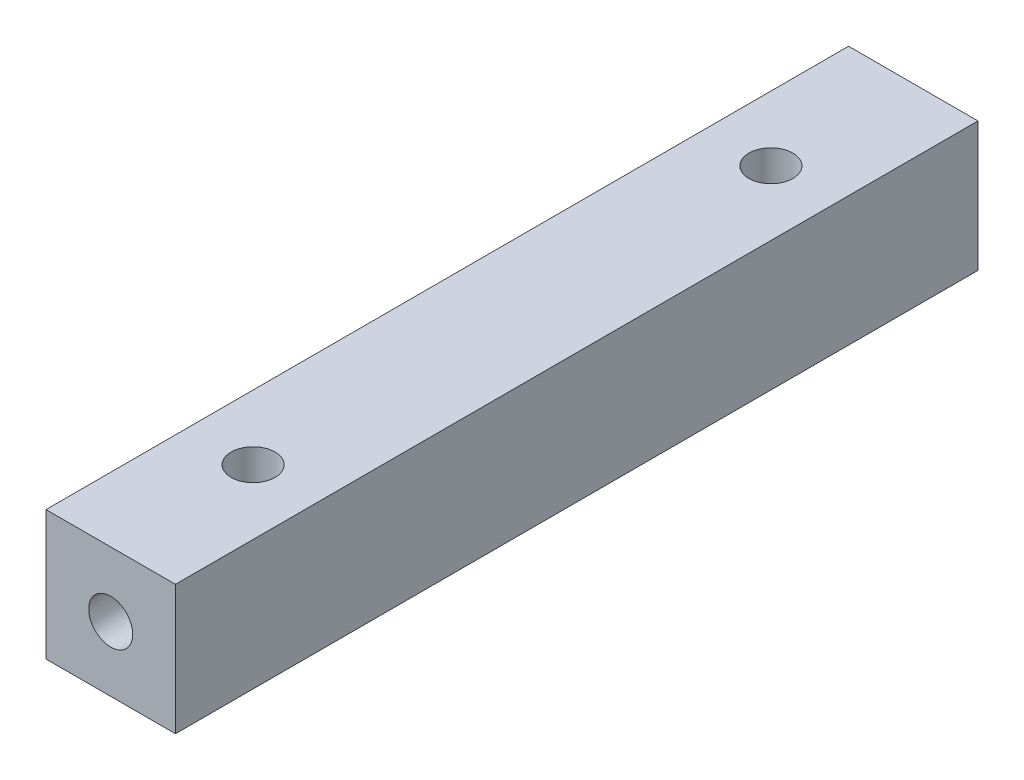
ISO-10303-21;
HEADER;
FILE_DESCRIPTION(('STEP AP214'),'2;1');
FILE_NAME('part.step','',(''),(''),'','','');
FILE_SCHEMA(('AUTOMOTIVE_DESIGN { 1 0 10303 214 1 1 1 1 }'));
ENDSEC;
DATA;
#1=APPLICATION_CONTEXT('core data for automotive mechanical design processes');
#2=APPLICATION_PROTOCOL_DEFINITION('international standard','automotive_design',2000,#1);
#3=PRODUCT_CONTEXT('',#1,'mechanical');
#4=PRODUCT('Part','Part','',(#3));
#5=PRODUCT_RELATED_PRODUCT_CATEGORY('part','',(#4));
#6=PRODUCT_DEFINITION_FORMATION('','',#4);
#7=PRODUCT_DEFINITION_CONTEXT('part definition',#1,'design');
#8=PRODUCT_DEFINITION('design','',#6,#7);
#9=PRODUCT_DEFINITION_SHAPE('','',#8);
#10=(LENGTH_UNIT() NAMED_UNIT(*) SI_UNIT(.MILLI.,.METRE.));
#11=(NAMED_UNIT(*) PLANE_ANGLE_UNIT() SI_UNIT($,.RADIAN.));
#12=(NAMED_UNIT(*) SI_UNIT($,.STERADIAN.) SOLID_ANGLE_UNIT());
#13=UNCERTAINTY_MEASURE_WITH_UNIT(LENGTH_MEASURE(1.E-05),#10,'distance_accuracy_value','');
#14=(GEOMETRIC_REPRESENTATION_CONTEXT(3) GLOBAL_UNCERTAINTY_ASSIGNED_CONTEXT((#13)) GLOBAL_UNIT_ASSIGNED_CONTEXT((#10,
#11,#12)) REPRESENTATION_CONTEXT('',''));
#15=CARTESIAN_POINT('',(0.,0.,0.));
#16=DIRECTION('',(0.,0.,1.));
#17=DIRECTION('',(1.,0.,0.));
#18=AXIS2_PLACEMENT_3D('',#15,#16,#17);
#19=CARTESIAN_POINT('',(0.,10.,-62.0000000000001));
#20=DIRECTION('',(0.,0.,-1.));
#21=DIRECTION('',(-1.,0.,0.));
#22=AXIS2_PLACEMENT_3D('',#19,#20,#21);
#23=CYLINDRICAL_SURFACE('',#22,3.39999999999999);
#24=CARTESIAN_POINT('',(0.,10.,-62.0000000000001));
#25=DIRECTION('',(0.,0.,-1.));
#26=DIRECTION('',(-1.,0.,0.));
#27=AXIS2_PLACEMENT_3D('',#24,#25,#26);
#28=CIRCLE('',#27,3.39999999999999);
#29=CARTESIAN_POINT('',(-3.39999999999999,10.,-62.0000000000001));
#30=VERTEX_POINT('',#29);
#31=EDGE_CURVE('E142',#30,#30,#28,.T.);
#32=ORIENTED_EDGE('',*,*,#31,.T.);
#33=EDGE_LOOP('',(#32));
#34=FACE_BOUND('',#33,.T.);
#35=CARTESIAN_POINT('',(1.11022302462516E-12,10.,-40.0000000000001));
#36=DIRECTION('',(0.,-0.707106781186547,-0.707106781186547));
#37=DIRECTION('',(0.,0.707106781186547,-0.707106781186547));
#38=AXIS2_PLACEMENT_3D('',#35,#36,#37);
#39=ELLIPSE('',#38,4.80832611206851,3.39999999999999);
#40=CARTESIAN_POINT('',(3.40000000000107,10.,-40.));
#41=VERTEX_POINT('',#40);
#42=CARTESIAN_POINT('',(-3.3999999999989,10.,-40.0000000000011));
#43=VERTEX_POINT('',#42);
#44=EDGE_CURVE('E148',#41,#43,#39,.F.);
#45=ORIENTED_EDGE('',*,*,#44,.T.);
#46=CARTESIAN_POINT('',(1.11022302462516E-12,10.,-40.0000000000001));
#47=DIRECTION('',(0.,0.707106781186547,-0.707106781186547));
#48=DIRECTION('',(0.,-0.707106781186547,-0.707106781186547));
#49=AXIS2_PLACEMENT_3D('',#46,#47,#48);
#50=ELLIPSE('',#49,4.80832611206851,3.39999999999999);
#51=EDGE_CURVE('E131',#43,#41,#50,.F.);
#52=ORIENTED_EDGE('',*,*,#51,.T.);
#53=EDGE_LOOP('',(#45,#52));
#54=FACE_BOUND('',#53,.T.);
#55=ADVANCED_FACE('F42',(#34,#54),#23,.F.);
#56=CARTESIAN_POINT('',(1.11022302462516E-12,9.9999999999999,62.));
#57=DIRECTION('',(0.,0.,1.));
#58=DIRECTION('',(1.,0.,0.));
#59=AXIS2_PLACEMENT_3D('',#56,#57,#58);
#60=CYLINDRICAL_SURFACE('',#59,3.39999999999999);
#61=CARTESIAN_POINT('',(1.11022302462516E-12,9.9999999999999,62.));
#62=DIRECTION('',(0.,0.,1.));
#63=DIRECTION('',(1.,0.,0.));
#64=AXIS2_PLACEMENT_3D('',#61,#62,#63);
#65=CIRCLE('',#64,3.39999999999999);
#66=CARTESIAN_POINT('',(3.4000000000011,9.9999999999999,62.));
#67=VERTEX_POINT('',#66);
#68=EDGE_CURVE('E183',#67,#67,#65,.T.);
#69=ORIENTED_EDGE('',*,*,#68,.T.);
#70=EDGE_LOOP('',(#69));
#71=FACE_BOUND('',#70,.T.);
#72=CARTESIAN_POINT('',(0.,10.,40.));
#73=DIRECTION('',(0.,-0.707106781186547,0.707106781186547));
#74=DIRECTION('',(0.,0.707106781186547,0.707106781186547));
#75=AXIS2_PLACEMENT_3D('',#72,#73,#74);
#76=ELLIPSE('',#75,4.80832611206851,3.39999999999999);
#77=CARTESIAN_POINT('',(-3.39999999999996,10.,40.));
#78=VERTEX_POINT('',#77);
#79=CARTESIAN_POINT('',(3.40000000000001,10.,40.0000000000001));
#80=VERTEX_POINT('',#79);
#81=EDGE_CURVE('E174',#78,#80,#76,.F.);
#82=ORIENTED_EDGE('',*,*,#81,.T.);
#83=CARTESIAN_POINT('',(0.,10.,40.));
#84=DIRECTION('',(0.,0.707106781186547,0.707106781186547));
#85=DIRECTION('',(0.,-0.707106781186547,0.707106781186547));
#86=AXIS2_PLACEMENT_3D('',#83,#84,#85);
#87=ELLIPSE('',#86,4.80832611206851,3.39999999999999);
#88=EDGE_CURVE('E169',#80,#78,#87,.F.);
#89=ORIENTED_EDGE('',*,*,#88,.T.);
#90=EDGE_LOOP('',(#82,#89));
#91=FACE_BOUND('',#90,.T.);
#92=ADVANCED_FACE('F273',(#71,#91),#60,.F.);
#93=CARTESIAN_POINT('',(-9.9999999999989,0.,62.0000000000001));
#94=DIRECTION('',(1.,0.,0.));
#95=DIRECTION('',(0.,0.,-1.));
#96=AXIS2_PLACEMENT_3D('',#93,#94,#95);
#97=PLANE('',#96);
#98=DIRECTION('',(0.,-1.,0.));
#99=VECTOR('',#98,1.);
#100=CARTESIAN_POINT('',(-10.,0.,-61.9999999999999));
#101=LINE('',#100,#99);
#102=CARTESIAN_POINT('',(-9.99999999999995,20.,-61.9999999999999));
#103=VERTEX_POINT('',#102);
#104=CARTESIAN_POINT('',(-10.,0.,-61.9999999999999));
#105=VERTEX_POINT('',#104);
#106=EDGE_CURVE('E186',#103,#105,#101,.T.);
#107=ORIENTED_EDGE('',*,*,#106,.T.);
#108=DIRECTION('',(0.,0.,-1.));
#109=VECTOR('',#108,1.);
#110=CARTESIAN_POINT('',(-9.9999999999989,0.,62.0000000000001));
#111=LINE('',#110,#109);
#112=CARTESIAN_POINT('',(-9.9999999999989,0.,62.0000000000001));
#113=VERTEX_POINT('',#112);
#114=EDGE_CURVE('E224',#113,#105,#111,.T.);
#115=ORIENTED_EDGE('',*,*,#114,.F.);
#116=DIRECTION('',(0.,-1.,0.));
#117=VECTOR('',#116,1.);
#118=CARTESIAN_POINT('',(-9.9999999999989,0.,62.0000000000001));
#119=LINE('',#118,#117);
#120=CARTESIAN_POINT('',(-9.9999999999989,19.9999999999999,62.0000000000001));
#121=VERTEX_POINT('',#120);
#122=EDGE_CURVE('E187',#121,#113,#119,.T.);
#123=ORIENTED_EDGE('',*,*,#122,.F.);
#124=DIRECTION('',(0.,0.,-1.));
#125=VECTOR('',#124,1.);
#126=CARTESIAN_POINT('',(-9.9999999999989,19.9999999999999,62.0000000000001));
#127=LINE('',#126,#125);
#128=EDGE_CURVE('E201',#121,#103,#127,.T.);
#129=ORIENTED_EDGE('',*,*,#128,.T.);
#130=EDGE_LOOP('',(#107,#115,#123,#129));
#131=FACE_BOUND('',#130,.T.);
#132=ADVANCED_FACE('F44',(#131),#97,.F.);
#133=CARTESIAN_POINT('',(-9.9999999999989,0.,62.0000000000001));
#134=DIRECTION('',(0.,1.,0.));
#135=DIRECTION('',(0.,0.,1.));
#136=AXIS2_PLACEMENT_3D('',#133,#134,#135);
#137=PLANE('',#136);
#138=CARTESIAN_POINT('',(1.11022302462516E-12,0.,-40.));
#139=DIRECTION('',(0.,1.,0.));
#140=DIRECTION('',(0.,0.,1.));
#141=AXIS2_PLACEMENT_3D('',#138,#139,#140);
#142=CIRCLE('',#141,3.4);
#143=CARTESIAN_POINT('',(1.11022302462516E-12,0.,-36.6));
#144=VERTEX_POINT('',#143);
#145=EDGE_CURVE('E460',#144,#144,#142,.T.);
#146=ORIENTED_EDGE('',*,*,#145,.T.);
#147=EDGE_LOOP('',(#146));
#148=FACE_BOUND('',#147,.T.);
#149=CARTESIAN_POINT('',(0.,0.,40.));
#150=DIRECTION('',(0.,1.,0.));
#151=DIRECTION('',(0.,0.,1.));
#152=AXIS2_PLACEMENT_3D('',#149,#150,#151);
#153=CIRCLE('',#152,3.4);
#154=CARTESIAN_POINT('',(0.,0.,43.4));
#155=VERTEX_POINT('',#154);
#156=EDGE_CURVE('E153',#155,#155,#153,.T.);
#157=ORIENTED_EDGE('',*,*,#156,.T.);
#158=EDGE_LOOP('',(#157));
#159=FACE_BOUND('',#158,.T.);
#160=DIRECTION('',(1.,0.,0.));
#161=VECTOR('',#160,1.);
#162=CARTESIAN_POINT('',(-10.,0.,-61.9999999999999));
#163=LINE('',#162,#161);
#164=CARTESIAN_POINT('',(10.,0.,-62.0000000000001));
#165=VERTEX_POINT('',#164);
#166=EDGE_CURVE('E205',#105,#165,#163,.T.);
#167=ORIENTED_EDGE('',*,*,#166,.T.);
#168=DIRECTION('',(0.,0.,-1.));
#169=VECTOR('',#168,1.);
#170=CARTESIAN_POINT('',(10.0000000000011,0.,62.0000000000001));
#171=LINE('',#170,#169);
#172=CARTESIAN_POINT('',(10.0000000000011,0.,62.0000000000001));
#173=VERTEX_POINT('',#172);
#174=EDGE_CURVE('E220',#173,#165,#171,.T.);
#175=ORIENTED_EDGE('',*,*,#174,.F.);
#176=DIRECTION('',(1.,0.,0.));
#177=VECTOR('',#176,1.);
#178=CARTESIAN_POINT('',(-9.9999999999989,0.,62.0000000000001));
#179=LINE('',#178,#177);
#180=EDGE_CURVE('E191',#113,#173,#179,.T.);
#181=ORIENTED_EDGE('',*,*,#180,.F.);
#182=ORIENTED_EDGE('',*,*,#114,.T.);
#183=EDGE_LOOP('',(#167,#175,#181,#182));
#184=FACE_BOUND('',#183,.T.);
#185=ADVANCED_FACE('F371',(#148,#159,#184),#137,.F.);
#186=CARTESIAN_POINT('',(10.0000000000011,0.,62.0000000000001));
#187=DIRECTION('',(-1.,0.,0.));
#188=DIRECTION('',(0.,0.,1.));
#189=AXIS2_PLACEMENT_3D('',#186,#187,#188);
#190=PLANE('',#189);
#191=DIRECTION('',(0.,1.,0.));
#192=VECTOR('',#191,1.);
#193=CARTESIAN_POINT('',(10.,0.,-62.0000000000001));
#194=LINE('',#193,#192);
#195=CARTESIAN_POINT('',(10.,20.,-62.0000000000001));
#196=VERTEX_POINT('',#195);
#197=EDGE_CURVE('E208',#165,#196,#194,.T.);
#198=ORIENTED_EDGE('',*,*,#197,.T.);
#199=DIRECTION('',(0.,0.,-1.));
#200=VECTOR('',#199,1.);
#201=CARTESIAN_POINT('',(10.0000000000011,19.9999999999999,62.0000000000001));
#202=LINE('',#201,#200);
#203=CARTESIAN_POINT('',(10.0000000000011,19.9999999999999,62.0000000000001));
#204=VERTEX_POINT('',#203);
#205=EDGE_CURVE('E216',#204,#196,#202,.T.);
#206=ORIENTED_EDGE('',*,*,#205,.F.);
#207=DIRECTION('',(0.,1.,0.));
#208=VECTOR('',#207,1.);
#209=CARTESIAN_POINT('',(10.0000000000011,0.,62.0000000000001));
#210=LINE('',#209,#208);
#211=EDGE_CURVE('E195',#173,#204,#210,.T.);
#212=ORIENTED_EDGE('',*,*,#211,.F.);
#213=ORIENTED_EDGE('',*,*,#174,.T.);
#214=EDGE_LOOP('',(#198,#206,#212,#213));
#215=FACE_BOUND('',#214,.T.);
#216=ADVANCED_FACE('F362',(#215),#190,.F.);
#217=CARTESIAN_POINT('',(-9.9999999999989,19.9999999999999,62.0000000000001));
#218=DIRECTION('',(0.,-1.,0.));
#219=DIRECTION('',(0.,0.,-1.));
#220=AXIS2_PLACEMENT_3D('',#217,#218,#219);
#221=PLANE('',#220);
#222=CARTESIAN_POINT('',(1.11022302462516E-12,20.,-40.));
#223=DIRECTION('',(0.,1.,0.));
#224=DIRECTION('',(0.,0.,1.));
#225=AXIS2_PLACEMENT_3D('',#222,#223,#224);
#226=CIRCLE('',#225,3.39999999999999);
#227=CARTESIAN_POINT('',(1.11022302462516E-12,20.,-36.6000000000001));
#228=VERTEX_POINT('',#227);
#229=EDGE_CURVE('E475',#228,#228,#226,.T.);
#230=ORIENTED_EDGE('',*,*,#229,.F.);
#231=EDGE_LOOP('',(#230));
#232=FACE_BOUND('',#231,.T.);
#233=CARTESIAN_POINT('',(0.,20.,40.));
#234=DIRECTION('',(0.,1.,0.));
#235=DIRECTION('',(0.,0.,1.));
#236=AXIS2_PLACEMENT_3D('',#233,#234,#235);
#237=CIRCLE('',#236,3.39999999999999);
#238=CARTESIAN_POINT('',(0.,20.,43.4));
#239=VERTEX_POINT('',#238);
#240=EDGE_CURVE('E157',#239,#239,#237,.T.);
#241=ORIENTED_EDGE('',*,*,#240,.F.);
#242=EDGE_LOOP('',(#241));
#243=FACE_BOUND('',#242,.T.);
#244=DIRECTION('',(-1.,0.,0.));
#245=VECTOR('',#244,1.);
#246=CARTESIAN_POINT('',(-9.99999999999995,20.,-61.9999999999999));
#247=LINE('',#246,#245);
#248=EDGE_CURVE('E192',#196,#103,#247,.T.);
#249=ORIENTED_EDGE('',*,*,#248,.T.);
#250=ORIENTED_EDGE('',*,*,#128,.F.);
#251=DIRECTION('',(-1.,0.,0.));
#252=VECTOR('',#251,1.);
#253=CARTESIAN_POINT('',(-9.9999999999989,19.9999999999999,62.0000000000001));
#254=LINE('',#253,#252);
#255=EDGE_CURVE('E198',#204,#121,#254,.T.);
#256=ORIENTED_EDGE('',*,*,#255,.F.);
#257=ORIENTED_EDGE('',*,*,#205,.T.);
#258=EDGE_LOOP('',(#249,#250,#256,#257));
#259=FACE_BOUND('',#258,.T.);
#260=ADVANCED_FACE('F353',(#232,#243,#259),#221,.F.);
#261=CARTESIAN_POINT('',(-9.9999999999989,19.9999999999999,62.0000000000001));
#262=DIRECTION('',(0.,0.,-1.));
#263=DIRECTION('',(-1.,0.,0.));
#264=AXIS2_PLACEMENT_3D('',#261,#262,#263);
#265=PLANE('',#264);
#266=ORIENTED_EDGE('',*,*,#68,.F.);
#267=EDGE_LOOP('',(#266));
#268=FACE_BOUND('',#267,.T.);
#269=ORIENTED_EDGE('',*,*,#122,.T.);
#270=ORIENTED_EDGE('',*,*,#180,.T.);
#271=ORIENTED_EDGE('',*,*,#211,.T.);
#272=ORIENTED_EDGE('',*,*,#255,.T.);
#273=EDGE_LOOP('',(#269,#270,#271,#272));
#274=FACE_BOUND('',#273,.T.);
#275=ADVANCED_FACE('F344',(#268,#274),#265,.F.);
#276=CARTESIAN_POINT('',(-9.99999999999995,20.,-61.9999999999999));
#277=DIRECTION('',(0.,0.,-1.));
#278=DIRECTION('',(-1.,0.,0.));
#279=AXIS2_PLACEMENT_3D('',#276,#277,#278);
#280=PLANE('',#279);
#281=ORIENTED_EDGE('',*,*,#31,.F.);
#282=EDGE_LOOP('',(#281));
#283=FACE_BOUND('',#282,.T.);
#284=ORIENTED_EDGE('',*,*,#106,.F.);
#285=ORIENTED_EDGE('',*,*,#248,.F.);
#286=ORIENTED_EDGE('',*,*,#197,.F.);
#287=ORIENTED_EDGE('',*,*,#166,.F.);
#288=EDGE_LOOP('',(#284,#285,#286,#287));
#289=FACE_BOUND('',#288,.T.);
#290=ADVANCED_FACE('F248',(#283,#289),#280,.T.);
#291=CARTESIAN_POINT('',(0.,20.,40.));
#292=DIRECTION('',(0.,1.,0.));
#293=DIRECTION('',(0.,0.,1.));
#294=AXIS2_PLACEMENT_3D('',#291,#292,#293);
#295=CYLINDRICAL_SURFACE('',#294,3.39999999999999);
#296=ORIENTED_EDGE('',*,*,#240,.T.);
#297=EDGE_LOOP('',(#296));
#298=FACE_BOUND('',#297,.T.);
#299=ORIENTED_EDGE('',*,*,#156,.F.);
#300=EDGE_LOOP('',(#299));
#301=FACE_BOUND('',#300,.T.);
#302=ORIENTED_EDGE('',*,*,#81,.F.);
#303=CARTESIAN_POINT('',(0.,10.,40.));
#304=DIRECTION('',(0.,0.707106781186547,0.707106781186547));
#305=DIRECTION('',(0.,-0.707106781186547,0.707106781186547));
#306=AXIS2_PLACEMENT_3D('',#303,#304,#305);
#307=ELLIPSE('',#306,4.80832611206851,3.39999999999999);
#308=CARTESIAN_POINT('',(-3.39079636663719,10.2499999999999,39.7500000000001));
#309=VERTEX_POINT('',#308);
#310=EDGE_CURVE('E164',#309,#78,#307,.T.);
#311=ORIENTED_EDGE('',*,*,#310,.F.);
#312=CARTESIAN_POINT('',(-2.8478101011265,3.70706174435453,41.8574115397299));
#313=CARTESIAN_POINT('',(-2.89754494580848,3.86899487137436,41.7811104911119));
#314=CARTESIAN_POINT('',(-2.94304604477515,4.03213135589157,41.7046961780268));
#315=CARTESIAN_POINT('',(-3.0262967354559,4.36043480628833,41.5521346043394));
#316=CARTESIAN_POINT('',(-3.06404873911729,4.52560112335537,41.4759872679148));
#317=CARTESIAN_POINT('',(-3.13255597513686,4.85773132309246,41.3243859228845));
#318=CARTESIAN_POINT('',(-3.16330943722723,5.0246956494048,41.2489320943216));
#319=CARTESIAN_POINT('',(-3.21838631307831,5.36023761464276,41.0992500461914));
#320=CARTESIAN_POINT('',(-3.24270924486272,5.52881537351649,41.0250219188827));
#321=CARTESIAN_POINT('',(-3.2853043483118,5.86633659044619,40.8789315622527));
#322=CARTESIAN_POINT('',(-3.30361743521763,6.03526934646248,40.8070564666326));
#323=CARTESIAN_POINT('',(-3.33493184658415,6.3747123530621,40.6659212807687));
#324=CARTESIAN_POINT('',(-3.3479331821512,6.54522260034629,40.5966611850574));
#325=CARTESIAN_POINT('',(-3.36917473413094,6.88788073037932,40.461857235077));
#326=CARTESIAN_POINT('',(-3.37741782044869,7.06002756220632,40.3963111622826));
#327=CARTESIAN_POINT('',(-3.3898228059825,7.40632277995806,40.270362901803));
#328=CARTESIAN_POINT('',(-3.39398554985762,7.58047074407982,40.2099596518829));
#329=CARTESIAN_POINT('',(-3.39737327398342,7.81226854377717,40.1348828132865));
#330=CARTESIAN_POINT('',(-3.39803254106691,7.86885613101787,40.1169693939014));
#331=CARTESIAN_POINT('',(-3.39905633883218,7.98228683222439,40.0819847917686));
#332=CARTESIAN_POINT('',(-3.39942090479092,8.03912991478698,40.0649135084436));
#333=CARTESIAN_POINT('',(-3.40012964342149,8.21032790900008,40.0150222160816));
#334=CARTESIAN_POINT('',(-3.40008547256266,8.32509732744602,39.9836079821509));
#335=CARTESIAN_POINT('',(-3.39913523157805,8.60615930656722,39.912674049));
#336=CARTESIAN_POINT('',(-3.39786151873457,8.77308391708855,39.8755979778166));
#337=CARTESIAN_POINT('',(-3.39504455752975,9.10926828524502,39.8138749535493));
#338=CARTESIAN_POINT('',(-3.39350133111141,9.27852785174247,39.7892269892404));
#339=CARTESIAN_POINT('',(-3.39121670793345,9.61817021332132,39.7551404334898));
#340=CARTESIAN_POINT('',(-3.39047313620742,9.78854868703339,39.7456605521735));
#341=CARTESIAN_POINT('',(-3.39027949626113,10.1294118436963,39.743072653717));
#342=CARTESIAN_POINT('',(-3.3908291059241,10.2998964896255,39.7499605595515));
#343=CARTESIAN_POINT('',(-3.39238265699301,10.5615488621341,39.7724319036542));
#344=CARTESIAN_POINT('',(-3.39306258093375,10.6532303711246,39.7825778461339));
#345=CARTESIAN_POINT('',(-3.39453952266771,10.8360266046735,39.8069861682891));
#346=CARTESIAN_POINT('',(-3.39533652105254,10.9271414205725,39.8212478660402));
#347=CARTESIAN_POINT('',(-3.39765214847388,11.199820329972,39.8696213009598));
#348=CARTESIAN_POINT('',(-3.39909243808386,11.380406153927,39.9092917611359));
#349=CARTESIAN_POINT('',(-3.40016307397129,11.6984582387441,39.9895464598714));
#350=CARTESIAN_POINT('',(-3.40012714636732,11.8365037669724,40.0279263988));
#351=CARTESIAN_POINT('',(-3.39847854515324,12.1105316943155,40.1097703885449));
#352=CARTESIAN_POINT('',(-3.39687160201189,12.246519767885,40.153215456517));
#353=CARTESIAN_POINT('',(-3.39419731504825,12.3818222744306,40.1985562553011));
#354=B_SPLINE_CURVE_WITH_KNOTS('',3,(#312,#313,#314,#315,#316,#317,#318,#319,#320,#321,#322,
#323,#324,#325,#326,#327,#328,#329,#330,#331,#332,#333,#334,#335,#336,#337,#338,#339,#340,#341,
#342,#343,#344,#345,#346,#347,#348,#349,#350,#351,#352,#353),.UNSPECIFIED.,.F.,.F.,(4,2,2,2,2,2,
2,2,2,2,2,2,2,2,2,2,2,2,2,2,4),(0.,0.557261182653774,1.11434865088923,1.67157687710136,
2.22884685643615,2.78224016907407,3.33563232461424,3.88869035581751,4.44163387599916,
4.6197050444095,4.79775489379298,5.15465677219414,5.66727681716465,6.1798551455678,
6.69103576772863,7.20208907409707,7.47873582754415,7.75533677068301,8.30947797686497,
8.73922172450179,9.16740375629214),.UNSPECIFIED.);
#355=CARTESIAN_POINT('',(-3.39079636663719,9.75000000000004,39.7500000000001));
#356=VERTEX_POINT('',#355);
#357=EDGE_CURVE('E228',#356,#309,#354,.T.);
#358=ORIENTED_EDGE('',*,*,#357,.F.);
#359=CARTESIAN_POINT('',(0.,10.,40.));
#360=DIRECTION('',(0.,-0.707106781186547,0.707106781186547));
#361=DIRECTION('',(0.,0.707106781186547,0.707106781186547));
#362=AXIS2_PLACEMENT_3D('',#359,#360,#361);
#363=ELLIPSE('',#362,4.80832611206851,3.39999999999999);
#364=EDGE_CURVE('E161',#78,#356,#363,.T.);
#365=ORIENTED_EDGE('',*,*,#364,.F.);
#366=ORIENTED_EDGE('',*,*,#88,.F.);
#367=CARTESIAN_POINT('',(3.39079636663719,9.75000000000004,39.75));
#368=VERTEX_POINT('',#367);
#369=EDGE_CURVE('E165',#368,#80,#363,.T.);
#370=ORIENTED_EDGE('',*,*,#369,.F.);
#371=CARTESIAN_POINT('',(3.39419731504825,12.3818222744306,40.1985562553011));
#372=CARTESIAN_POINT('',(3.39686643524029,12.2467750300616,40.153298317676));
#373=CARTESIAN_POINT('',(3.39847252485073,12.1110310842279,40.1099286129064));
#374=CARTESIAN_POINT('',(3.40012712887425,11.836999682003,40.0280652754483));
#375=CARTESIAN_POINT('',(3.40016418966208,11.6987008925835,39.9896095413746));
#376=CARTESIAN_POINT('',(3.39913665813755,11.3936483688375,39.9126309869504));
#377=CARTESIAN_POINT('',(3.39785911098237,11.2265311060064,39.8755138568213));
#378=CARTESIAN_POINT('',(3.39503728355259,10.889963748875,39.8137473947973));
#379=CARTESIAN_POINT('',(3.39349303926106,10.7205139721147,39.7890963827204));
#380=CARTESIAN_POINT('',(3.39121207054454,10.3808711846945,39.7550786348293));
#381=CARTESIAN_POINT('',(3.39047138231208,10.210686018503,39.7456367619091));
#382=CARTESIAN_POINT('',(3.39028059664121,9.87020707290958,39.7430877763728));
#383=CARTESIAN_POINT('',(3.39083020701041,9.69991332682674,39.7499769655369));
#384=CARTESIAN_POINT('',(3.39238250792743,9.43847880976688,39.7724294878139));
#385=CARTESIAN_POINT('',(3.39306217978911,9.34682511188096,39.7825715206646));
#386=CARTESIAN_POINT('',(3.39453859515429,9.16408234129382,39.806970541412));
#387=CARTESIAN_POINT('',(3.39533531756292,9.07299316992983,39.8212267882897));
#388=CARTESIAN_POINT('',(3.3968788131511,8.89125148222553,39.8534622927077));
#389=CARTESIAN_POINT('',(3.39762545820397,8.80060059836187,39.8714506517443));
#390=CARTESIAN_POINT('',(3.39888280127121,8.62000387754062,39.9106606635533));
#391=CARTESIAN_POINT('',(3.39939349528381,8.53005805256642,39.9318823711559));
#392=CARTESIAN_POINT('',(3.4002505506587,8.27574128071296,39.9960606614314));
#393=CARTESIAN_POINT('',(3.40010009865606,8.11220122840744,40.0423218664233));
#394=CARTESIAN_POINT('',(3.39740699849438,7.78724604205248,40.1417902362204));
#395=CARTESIAN_POINT('',(3.39486350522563,7.62583167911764,40.1949998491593));
#396=CARTESIAN_POINT('',(3.38661286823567,7.30465094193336,40.3065758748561));
#397=CARTESIAN_POINT('',(3.38090161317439,7.14488698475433,40.3649489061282));
#398=CARTESIAN_POINT('',(3.36571786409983,6.82698019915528,40.4854190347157));
#399=CARTESIAN_POINT('',(3.35624585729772,6.66883716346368,40.5475156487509));
#400=CARTESIAN_POINT('',(3.33305411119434,6.35388231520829,40.6744769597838));
#401=CARTESIAN_POINT('',(3.31933210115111,6.19707126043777,40.7393431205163));
#402=CARTESIAN_POINT('',(3.28722215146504,5.88475723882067,40.8710732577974));
#403=CARTESIAN_POINT('',(3.26883387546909,5.72925436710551,40.9379373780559));
#404=CARTESIAN_POINT('',(3.22701448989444,5.41970023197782,41.0730211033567));
#405=CARTESIAN_POINT('',(3.20358830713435,5.26564770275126,41.1412393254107));
#406=CARTESIAN_POINT('',(3.15126921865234,4.95890479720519,41.2786337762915));
#407=CARTESIAN_POINT('',(3.12237640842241,4.80621439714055,41.3478099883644));
#408=CARTESIAN_POINT('',(3.05702606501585,4.49446079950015,41.4903235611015));
#409=CARTESIAN_POINT('',(3.02025453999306,4.33547650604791,41.563691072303));
#410=CARTESIAN_POINT('',(2.93955922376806,4.01964452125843,41.710544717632));
#411=CARTESIAN_POINT('',(2.89564426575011,3.86279444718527,41.7840305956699));
#412=CARTESIAN_POINT('',(2.8478101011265,3.70706174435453,41.8574115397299));
#413=B_SPLINE_CURVE_WITH_KNOTS('',3,(#371,#372,#373,#374,#375,#376,#377,#378,#379,#380,#381,
#382,#383,#384,#385,#386,#387,#388,#389,#390,#391,#392,#393,#394,#395,#396,#397,#398,#399,#400,
#401,#402,#403,#404,#405,#406,#407,#408,#409,#410,#411,#412),.UNSPECIFIED.,.F.,.F.,(4,2,2,2,2,2,
2,2,2,2,2,2,2,2,2,2,2,2,2,2,4),(0.,0.427403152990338,0.857925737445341,1.37113614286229,
1.88427735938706,2.39487566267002,2.90535835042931,3.18192284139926,3.45843755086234,
3.7356346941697,4.01283653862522,4.52246141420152,5.03226633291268,5.5427344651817,
6.05313648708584,6.56381168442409,7.0745237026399,7.5847385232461,8.09494443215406,
8.63154169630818,9.16748040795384),.UNSPECIFIED.);
#414=CARTESIAN_POINT('',(3.39079636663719,10.2499999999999,39.75));
#415=VERTEX_POINT('',#414);
#416=EDGE_CURVE('E127',#415,#368,#413,.T.);
#417=ORIENTED_EDGE('',*,*,#416,.F.);
#418=EDGE_CURVE('E170',#80,#415,#307,.T.);
#419=ORIENTED_EDGE('',*,*,#418,.F.);
#420=EDGE_LOOP('',(#302,#311,#358,#365,#366,#370,#417,#419));
#421=FACE_BOUND('',#420,.T.);
#422=ADVANCED_FACE('F243',(#298,#301,#421),#295,.F.);
#423=CARTESIAN_POINT('',(0.,10.,39.75));
#424=DIRECTION('',(0.,0.,1.));
#425=DIRECTION('',(1.,0.,0.));
#426=AXIS2_PLACEMENT_3D('',#423,#424,#425);
#427=CONICAL_SURFACE('',#426,3.39999999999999,1.02974425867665);
#428=CARTESIAN_POINT('',(0.,10.,39.75));
#429=DIRECTION('',(0.,0.,1.));
#430=DIRECTION('',(1.,0.,0.));
#431=AXIS2_PLACEMENT_3D('',#428,#429,#430);
#432=CIRCLE('',#431,3.39999999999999);
#433=EDGE_CURVE('E178',#368,#415,#432,.T.);
#434=ORIENTED_EDGE('',*,*,#433,.T.);
#435=ORIENTED_EDGE('',*,*,#416,.T.);
#436=EDGE_LOOP('',(#434,#435));
#437=FACE_BOUND('',#436,.T.);
#438=ADVANCED_FACE('F247',(#437),#427,.F.);
#439=ORIENTED_EDGE('',*,*,#369,.T.);
#440=ORIENTED_EDGE('',*,*,#418,.T.);
#441=ORIENTED_EDGE('',*,*,#433,.F.);
#442=EDGE_LOOP('',(#439,#440,#441));
#443=FACE_BOUND('',#442,.T.);
#444=ADVANCED_FACE('F272',(#443),#60,.F.);
#445=EDGE_CURVE('E182',#309,#356,#432,.T.);
#446=ORIENTED_EDGE('',*,*,#445,.T.);
#447=ORIENTED_EDGE('',*,*,#357,.T.);
#448=EDGE_LOOP('',(#446,#447));
#449=FACE_BOUND('',#448,.T.);
#450=ADVANCED_FACE('F240',(#449),#427,.F.);
#451=ORIENTED_EDGE('',*,*,#445,.F.);
#452=ORIENTED_EDGE('',*,*,#310,.T.);
#453=ORIENTED_EDGE('',*,*,#364,.T.);
#454=EDGE_LOOP('',(#451,#452,#453));
#455=FACE_BOUND('',#454,.T.);
#456=ADVANCED_FACE('F263',(#455),#60,.F.);
#457=CARTESIAN_POINT('',(1.11022302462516E-12,20.,-40.));
#458=DIRECTION('',(0.,1.,0.));
#459=DIRECTION('',(0.,0.,1.));
#460=AXIS2_PLACEMENT_3D('',#457,#458,#459);
#461=CYLINDRICAL_SURFACE('',#460,3.39999999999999);
#462=ORIENTED_EDGE('',*,*,#229,.T.);
#463=EDGE_LOOP('',(#462));
#464=FACE_BOUND('',#463,.T.);
#465=ORIENTED_EDGE('',*,*,#145,.F.);
#466=EDGE_LOOP('',(#465));
#467=FACE_BOUND('',#466,.T.);
#468=CARTESIAN_POINT('',(2.84781010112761,3.70706174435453,-41.8574115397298));
#469=CARTESIAN_POINT('',(2.89754494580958,3.86899487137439,-41.7811104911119));
#470=CARTESIAN_POINT('',(2.94304604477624,4.03213135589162,-41.7046961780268));
#471=CARTESIAN_POINT('',(3.02629673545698,4.36043480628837,-41.5521346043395));
#472=CARTESIAN_POINT('',(3.06404873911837,4.5256011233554,-41.4759872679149));
#473=CARTESIAN_POINT('',(3.13255597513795,4.85773132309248,-41.3243859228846));
#474=CARTESIAN_POINT('',(3.16330943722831,5.02469564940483,-41.2489320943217));
#475=CARTESIAN_POINT('',(3.2183863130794,5.36023761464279,-41.0992500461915));
#476=CARTESIAN_POINT('',(3.24270924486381,5.52881537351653,-41.0250219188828));
#477=CARTESIAN_POINT('',(3.2853043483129,5.86633659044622,-40.8789315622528));
#478=CARTESIAN_POINT('',(3.30361743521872,6.03526934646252,-40.8070564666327));
#479=CARTESIAN_POINT('',(3.33493184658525,6.37471235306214,-40.6659212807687));
#480=CARTESIAN_POINT('',(3.3479331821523,6.54522260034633,-40.5966611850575));
#481=CARTESIAN_POINT('',(3.36917473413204,6.88788073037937,-40.4618572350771));
#482=CARTESIAN_POINT('',(3.37741782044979,7.06002756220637,-40.3963111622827));
#483=CARTESIAN_POINT('',(3.38982280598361,7.40632277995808,-40.270362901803));
#484=CARTESIAN_POINT('',(3.39398554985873,7.5804707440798,-40.2099596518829));
#485=CARTESIAN_POINT('',(3.39737327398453,7.81226854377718,-40.1348828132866));
#486=CARTESIAN_POINT('',(3.39803254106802,7.86885613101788,-40.1169693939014));
#487=CARTESIAN_POINT('',(3.39905633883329,7.98228683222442,-40.0819847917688));
#488=CARTESIAN_POINT('',(3.39942090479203,8.039129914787,-40.0649135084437));
#489=CARTESIAN_POINT('',(3.4001296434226,8.2103279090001,-40.0150222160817));
#490=CARTESIAN_POINT('',(3.40008547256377,8.32509732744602,-39.9836079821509));
#491=CARTESIAN_POINT('',(3.39913523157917,8.60615930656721,-39.912674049));
#492=CARTESIAN_POINT('',(3.39786151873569,8.77308391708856,-39.8755979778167));
#493=CARTESIAN_POINT('',(3.39504455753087,9.10926828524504,-39.8138749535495));
#494=CARTESIAN_POINT('',(3.39350133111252,9.27852785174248,-39.7892269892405));
#495=CARTESIAN_POINT('',(3.39121670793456,9.61817021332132,-39.7551404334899));
#496=CARTESIAN_POINT('',(3.39047313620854,9.7885486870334,-39.7456605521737));
#497=CARTESIAN_POINT('',(3.39027949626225,10.1294118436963,-39.743072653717));
#498=CARTESIAN_POINT('',(3.39082910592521,10.2998964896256,-39.7499605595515));
#499=CARTESIAN_POINT('',(3.39238265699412,10.5615488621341,-39.7724319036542));
#500=CARTESIAN_POINT('',(3.39306258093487,10.6532303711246,-39.7825778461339));
#501=CARTESIAN_POINT('',(3.39453952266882,10.8360266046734,-39.8069861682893));
#502=CARTESIAN_POINT('',(3.39533652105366,10.9271414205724,-39.8212478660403));
#503=CARTESIAN_POINT('',(3.39765214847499,11.199820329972,-39.8696213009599));
#504=CARTESIAN_POINT('',(3.39909243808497,11.3804061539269,-39.9092917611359));
#505=CARTESIAN_POINT('',(3.4001630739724,11.698458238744,-39.9895464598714));
#506=CARTESIAN_POINT('',(3.40012714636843,11.8365037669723,-40.0279263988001));
#507=CARTESIAN_POINT('',(3.39847854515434,12.1105316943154,-40.109770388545));
#508=CARTESIAN_POINT('',(3.396871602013,12.246519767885,-40.1532154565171));
#509=CARTESIAN_POINT('',(3.39419731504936,12.3818222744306,-40.1985562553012));
#510=B_SPLINE_CURVE_WITH_KNOTS('',3,(#468,#469,#470,#471,#472,#473,#474,#475,#476,#477,#478,
#479,#480,#481,#482,#483,#484,#485,#486,#487,#488,#489,#490,#491,#492,#493,#494,#495,#496,#497,
#498,#499,#500,#501,#502,#503,#504,#505,#506,#507,#508,#509),.UNSPECIFIED.,.F.,.F.,(4,2,2,2,2,2,
2,2,2,2,2,2,2,2,2,2,2,2,2,2,4),(0.,0.55726118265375,1.11434865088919,1.67157687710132,
2.22884685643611,2.78224016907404,3.33563232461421,3.88869035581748,4.44163387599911,
4.61970504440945,4.79775489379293,5.1546567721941,5.6672768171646,6.17985514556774,
6.69103576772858,7.202089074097,7.47873582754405,7.75533677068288,8.30947797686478,
8.73922172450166,9.16740375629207),.UNSPECIFIED.);
#511=CARTESIAN_POINT('',(3.3907963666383,9.75000000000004,-39.7500000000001));
#512=VERTEX_POINT('',#511);
#513=CARTESIAN_POINT('',(3.3907963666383,10.2499999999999,-39.7500000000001));
#514=VERTEX_POINT('',#513);
#515=EDGE_CURVE('E11',#512,#514,#510,.T.);
#516=ORIENTED_EDGE('',*,*,#515,.F.);
#517=CARTESIAN_POINT('',(1.11022302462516E-12,10.,-40.0000000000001));
#518=DIRECTION('',(0.,-0.707106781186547,-0.707106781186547));
#519=DIRECTION('',(0.,0.707106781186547,-0.707106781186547));
#520=AXIS2_PLACEMENT_3D('',#517,#518,#519);
#521=ELLIPSE('',#520,4.80832611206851,3.39999999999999);
#522=EDGE_CURVE('E145',#41,#512,#521,.T.);
#523=ORIENTED_EDGE('',*,*,#522,.F.);
#524=ORIENTED_EDGE('',*,*,#51,.F.);
#525=CARTESIAN_POINT('',(-3.39079636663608,9.75000000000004,-39.750000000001));
#526=VERTEX_POINT('',#525);
#527=EDGE_CURVE('E63',#526,#43,#521,.T.);
#528=ORIENTED_EDGE('',*,*,#527,.F.);
#529=CARTESIAN_POINT('',(-3.39419731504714,12.3818222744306,-40.1985562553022));
#530=CARTESIAN_POINT('',(-3.39686643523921,12.2467750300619,-40.153298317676));
#531=CARTESIAN_POINT('',(-3.39847252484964,12.1110310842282,-40.1099286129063));
#532=CARTESIAN_POINT('',(-3.40012712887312,11.8369996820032,-40.0280652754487));
#533=CARTESIAN_POINT('',(-3.40016418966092,11.6987008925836,-39.9896095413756));
#534=CARTESIAN_POINT('',(-3.39913665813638,11.3936483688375,-39.9126309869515));
#535=CARTESIAN_POINT('',(-3.39785911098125,11.2265311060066,-39.8755138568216));
#536=CARTESIAN_POINT('',(-3.3950372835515,10.8899637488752,-39.8137473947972));
#537=CARTESIAN_POINT('',(-3.39349303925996,10.7205139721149,-39.7890963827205));
#538=CARTESIAN_POINT('',(-3.39121207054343,10.3808711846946,-39.7550786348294));
#539=CARTESIAN_POINT('',(-3.39047138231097,10.2106860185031,-39.7456367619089));
#540=CARTESIAN_POINT('',(-3.3902805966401,9.87020707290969,-39.7430877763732));
#541=CARTESIAN_POINT('',(-3.3908302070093,9.69991332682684,-39.7499769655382));
#542=CARTESIAN_POINT('',(-3.39238250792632,9.43847880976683,-39.7724294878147));
#543=CARTESIAN_POINT('',(-3.393062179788,9.34682511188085,-39.7825715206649));
#544=CARTESIAN_POINT('',(-3.39453859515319,9.16408234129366,-39.806970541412));
#545=CARTESIAN_POINT('',(-3.39533531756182,9.07299316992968,-39.8212267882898));
#546=CARTESIAN_POINT('',(-3.39687881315,8.89125148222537,-39.8534622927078));
#547=CARTESIAN_POINT('',(-3.39762545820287,8.80060059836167,-39.8714506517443));
#548=CARTESIAN_POINT('',(-3.3988828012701,8.6200038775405,-39.9106606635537));
#549=CARTESIAN_POINT('',(-3.3993934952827,8.5300580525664,-39.9318823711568));
#550=CARTESIAN_POINT('',(-3.40025055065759,8.275741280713,-39.9960606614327));
#551=CARTESIAN_POINT('',(-3.40010009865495,8.11220122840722,-40.0423218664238));
#552=CARTESIAN_POINT('',(-3.39740699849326,7.78724604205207,-40.1417902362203));
#553=CARTESIAN_POINT('',(-3.39486350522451,7.62583167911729,-40.1949998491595));
#554=CARTESIAN_POINT('',(-3.38661286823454,7.30465094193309,-40.3065758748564));
#555=CARTESIAN_POINT('',(-3.38090161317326,7.14488698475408,-40.3649489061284));
#556=CARTESIAN_POINT('',(-3.36571786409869,6.82698019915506,-40.4854190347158));
#557=CARTESIAN_POINT('',(-3.35624585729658,6.66883716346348,-40.5475156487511));
#558=CARTESIAN_POINT('',(-3.3330541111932,6.35388231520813,-40.674476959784));
#559=CARTESIAN_POINT('',(-3.31933210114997,6.19707126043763,-40.7393431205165));
#560=CARTESIAN_POINT('',(-3.2872221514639,5.88475723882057,-40.8710732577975));
#561=CARTESIAN_POINT('',(-3.26883387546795,5.72925436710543,-40.937937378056));
#562=CARTESIAN_POINT('',(-3.22701448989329,5.41970023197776,-41.0730211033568));
#563=CARTESIAN_POINT('',(-3.2035883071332,5.2656477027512,-41.1412393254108));
#564=CARTESIAN_POINT('',(-3.1512692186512,4.95890479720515,-41.2786337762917));
#565=CARTESIAN_POINT('',(-3.1223764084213,4.80621439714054,-41.3478099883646));
#566=CARTESIAN_POINT('',(-3.05702606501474,4.49446079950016,-41.4903235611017));
#567=CARTESIAN_POINT('',(-3.02025453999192,4.33547650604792,-41.5636910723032));
#568=CARTESIAN_POINT('',(-2.93955922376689,4.01964452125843,-41.710544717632));
#569=CARTESIAN_POINT('',(-2.89564426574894,3.86279444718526,-41.7840305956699));
#570=CARTESIAN_POINT('',(-2.84781010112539,3.70706174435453,-41.8574115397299));
#571=B_SPLINE_CURVE_WITH_KNOTS('',3,(#529,#530,#531,#532,#533,#534,#535,#536,#537,#538,#539,
#540,#541,#542,#543,#544,#545,#546,#547,#548,#549,#550,#551,#552,#553,#554,#555,#556,#557,#558,
#559,#560,#561,#562,#563,#564,#565,#566,#567,#568,#569,#570),.UNSPECIFIED.,.F.,.F.,(4,2,2,2,2,2,
2,2,2,2,2,2,2,2,2,2,2,2,2,2,4),(0.,0.427403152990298,0.857925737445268,1.37113614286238,
1.88427735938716,2.3948756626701,2.90535835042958,3.18192284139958,3.45843755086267,
3.73563469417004,4.0128365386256,4.52246141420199,5.03226633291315,5.54273446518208,
6.05313648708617,6.56381168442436,7.07452370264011,7.5847385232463,8.09494443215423,
8.63154169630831,9.16748040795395),.UNSPECIFIED.);
#572=CARTESIAN_POINT('',(-3.39079636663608,10.2499999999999,-39.750000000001));
#573=VERTEX_POINT('',#572);
#574=EDGE_CURVE('E56',#573,#526,#571,.T.);
#575=ORIENTED_EDGE('',*,*,#574,.F.);
#576=CARTESIAN_POINT('',(1.11022302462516E-12,10.,-40.0000000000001));
#577=DIRECTION('',(0.,0.707106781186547,-0.707106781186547));
#578=DIRECTION('',(0.,-0.707106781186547,-0.707106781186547));
#579=AXIS2_PLACEMENT_3D('',#576,#577,#578);
#580=ELLIPSE('',#579,4.80832611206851,3.39999999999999);
#581=EDGE_CURVE('E123',#43,#573,#580,.T.);
#582=ORIENTED_EDGE('',*,*,#581,.F.);
#583=ORIENTED_EDGE('',*,*,#44,.F.);
#584=EDGE_CURVE('E133',#514,#41,#580,.T.);
#585=ORIENTED_EDGE('',*,*,#584,.F.);
#586=EDGE_LOOP('',(#516,#523,#524,#528,#575,#582,#583,#585));
#587=FACE_BOUND('',#586,.T.);
#588=ADVANCED_FACE('F122',(#464,#467,#587),#461,.F.);
#589=CARTESIAN_POINT('',(1.11022302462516E-12,10.,-39.7500000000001));
#590=DIRECTION('',(0.,0.,-1.));
#591=DIRECTION('',(-1.,0.,0.));
#592=AXIS2_PLACEMENT_3D('',#589,#590,#591);
#593=CONICAL_SURFACE('',#592,3.39999999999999,1.02974425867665);
#594=CARTESIAN_POINT('',(1.11022302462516E-12,10.,-39.7500000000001));
#595=DIRECTION('',(0.,0.,-1.));
#596=DIRECTION('',(-1.,0.,0.));
#597=AXIS2_PLACEMENT_3D('',#594,#595,#596);
#598=CIRCLE('',#597,3.39999999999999);
#599=EDGE_CURVE('E136',#514,#512,#598,.T.);
#600=ORIENTED_EDGE('',*,*,#599,.T.);
#601=ORIENTED_EDGE('',*,*,#515,.T.);
#602=EDGE_LOOP('',(#600,#601));
#603=FACE_BOUND('',#602,.T.);
#604=ADVANCED_FACE('F253',(#603),#593,.F.);
#605=ORIENTED_EDGE('',*,*,#599,.F.);
#606=ORIENTED_EDGE('',*,*,#584,.T.);
#607=ORIENTED_EDGE('',*,*,#522,.T.);
#608=EDGE_LOOP('',(#605,#606,#607));
#609=FACE_BOUND('',#608,.T.);
#610=ADVANCED_FACE('F250',(#609),#23,.F.);
#611=EDGE_CURVE('E129',#526,#573,#598,.T.);
#612=ORIENTED_EDGE('',*,*,#611,.T.);
#613=ORIENTED_EDGE('',*,*,#574,.T.);
#614=EDGE_LOOP('',(#612,#613));
#615=FACE_BOUND('',#614,.T.);
#616=ADVANCED_FACE('F134',(#615),#593,.F.);
#617=ORIENTED_EDGE('',*,*,#527,.T.);
#618=ORIENTED_EDGE('',*,*,#581,.T.);
#619=ORIENTED_EDGE('',*,*,#611,.F.);
#620=EDGE_LOOP('',(#617,#618,#619));
#621=FACE_BOUND('',#620,.T.);
#622=ADVANCED_FACE('F128',(#621),#23,.F.);
#623=CLOSED_SHELL('',(#55,#92,#132,#185,#216,#260,#275,#290,#422,#438,#444,#450,#456,#588,#604,
#610,#616,#622));
#624=MANIFOLD_SOLID_BREP('B2',#623);
#625=ADVANCED_BREP_SHAPE_REPRESENTATION('',(#18,#624),#14);
#626=SHAPE_DEFINITION_REPRESENTATION(#9,#625);
ENDSEC;
END-ISO-10303-21;
